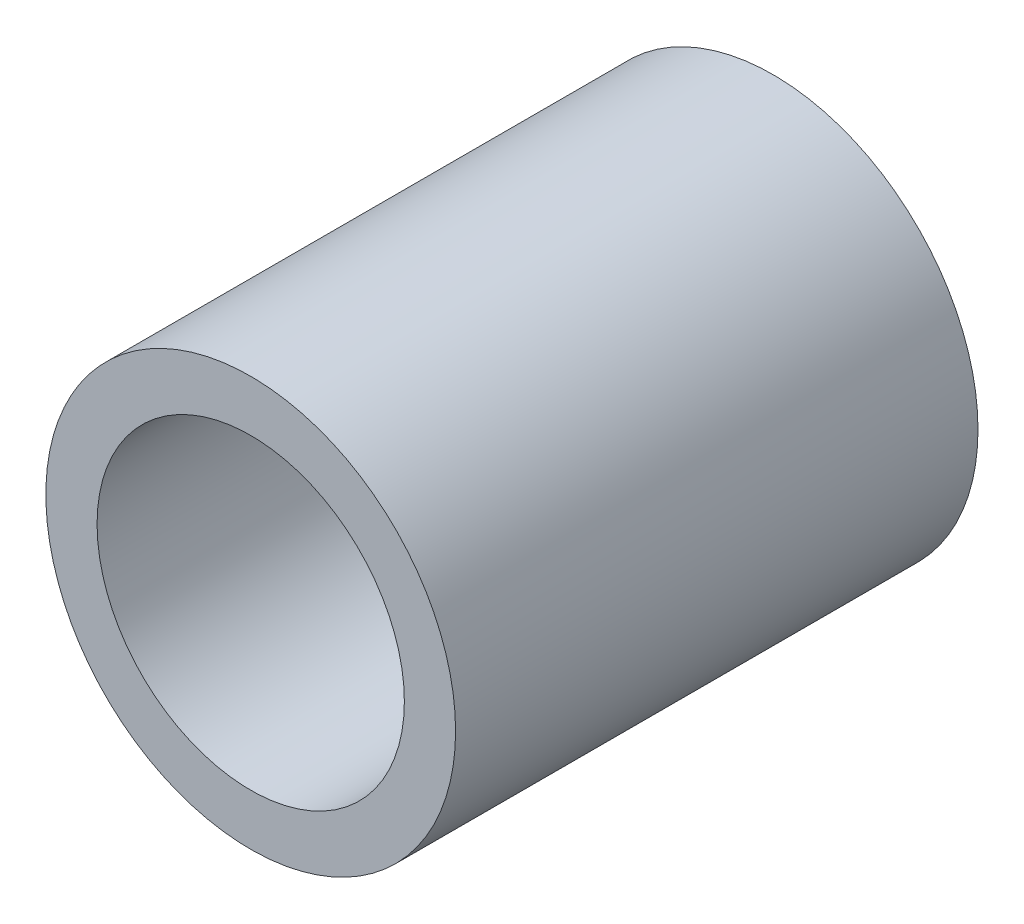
from build123d import *

# Parameters (mm, degrees)
ESQUISSE1_R          = 10
ESQUISSE1_R_2        = 7.5
BASE_EXTRUSION_DEPTH = 25.5


with BuildPart() as part:
    # Esquisse1 → Base-Extrusion (new body)
    with BuildSketch(Plane.XY):
        Circle(ESQUISSE1_R)
        Circle(ESQUISSE1_R_2, mode=Mode.SUBTRACT)
    extrude(amount=BASE_EXTRUSION_DEPTH)


solid = part.part
